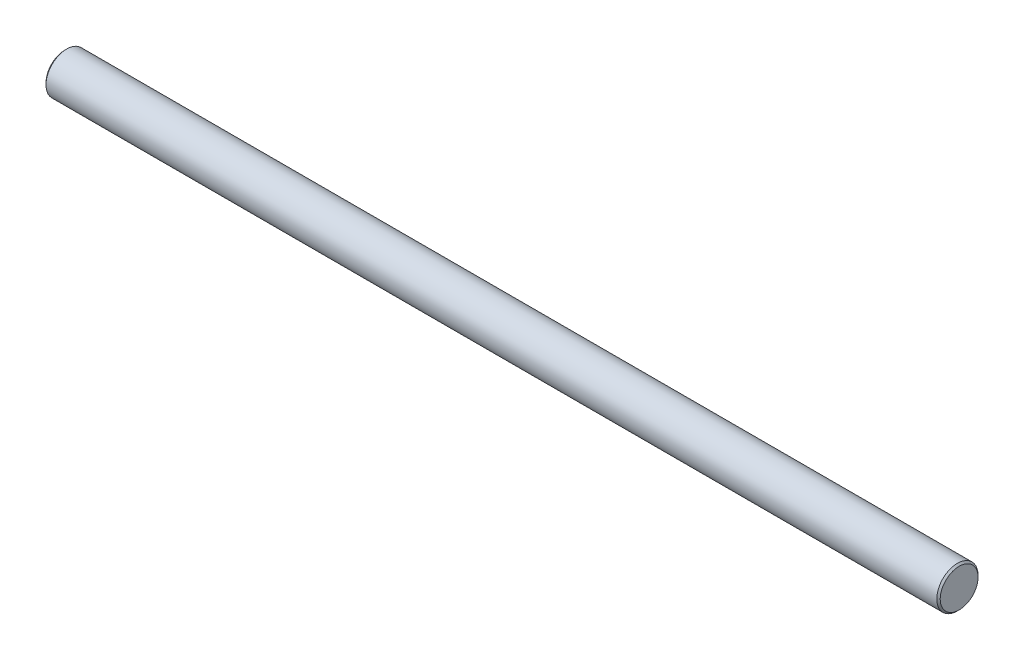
ISO-10303-21;
HEADER;
FILE_DESCRIPTION(('STEP AP214'),'2;1');
FILE_NAME('part.step','',(''),(''),'','','');
FILE_SCHEMA(('AUTOMOTIVE_DESIGN { 1 0 10303 214 1 1 1 1 }'));
ENDSEC;
DATA;
#1=APPLICATION_CONTEXT('core data for automotive mechanical design processes');
#2=APPLICATION_PROTOCOL_DEFINITION('international standard','automotive_design',2000,#1);
#3=PRODUCT_CONTEXT('',#1,'mechanical');
#4=PRODUCT('Part','Part','',(#3));
#5=PRODUCT_RELATED_PRODUCT_CATEGORY('part','',(#4));
#6=PRODUCT_DEFINITION_FORMATION('','',#4);
#7=PRODUCT_DEFINITION_CONTEXT('part definition',#1,'design');
#8=PRODUCT_DEFINITION('design','',#6,#7);
#9=PRODUCT_DEFINITION_SHAPE('','',#8);
#10=(LENGTH_UNIT() NAMED_UNIT(*) SI_UNIT(.MILLI.,.METRE.));
#11=(NAMED_UNIT(*) PLANE_ANGLE_UNIT() SI_UNIT($,.RADIAN.));
#12=(NAMED_UNIT(*) SI_UNIT($,.STERADIAN.) SOLID_ANGLE_UNIT());
#13=UNCERTAINTY_MEASURE_WITH_UNIT(LENGTH_MEASURE(1.E-05),#10,'distance_accuracy_value','');
#14=(GEOMETRIC_REPRESENTATION_CONTEXT(3) GLOBAL_UNCERTAINTY_ASSIGNED_CONTEXT((#13)) GLOBAL_UNIT_ASSIGNED_CONTEXT((#10,
#11,#12)) REPRESENTATION_CONTEXT('',''));
#15=CARTESIAN_POINT('',(0.,0.,0.));
#16=DIRECTION('',(0.,0.,1.));
#17=DIRECTION('',(1.,0.,0.));
#18=AXIS2_PLACEMENT_3D('',#15,#16,#17);
#19=CARTESIAN_POINT('',(-40.,0.,0.));
#20=DIRECTION('',(1.,0.,0.));
#21=DIRECTION('',(0.,0.,-1.));
#22=AXIS2_PLACEMENT_3D('',#19,#20,#21);
#23=PLANE('',#22);
#24=CARTESIAN_POINT('',(-40.,0.,0.));
#25=DIRECTION('',(1.,0.,0.));
#26=DIRECTION('',(0.,0.,-1.));
#27=AXIS2_PLACEMENT_3D('',#24,#25,#26);
#28=CIRCLE('',#27,2.75);
#29=CARTESIAN_POINT('',(-40.,0.,-2.75));
#30=VERTEX_POINT('',#29);
#31=EDGE_CURVE('E10',#30,#30,#28,.F.);
#32=ORIENTED_EDGE('',*,*,#31,.T.);
#33=EDGE_LOOP('',(#32));
#34=FACE_BOUND('',#33,.T.);
#35=ADVANCED_FACE('F30',(#34),#23,.F.);
#36=CARTESIAN_POINT('',(-16.2473877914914,0.,0.));
#37=DIRECTION('',(-1.,0.,0.));
#38=DIRECTION('',(0.,0.,1.));
#39=AXIS2_PLACEMENT_3D('',#36,#37,#38);
#40=CYLINDRICAL_SURFACE('',#39,3.);
#41=CARTESIAN_POINT('',(89.75,0.,0.));
#42=DIRECTION('',(-1.,0.,0.));
#43=DIRECTION('',(0.,0.,1.));
#44=AXIS2_PLACEMENT_3D('',#41,#42,#43);
#45=CIRCLE('',#44,3.);
#46=CARTESIAN_POINT('',(89.75,0.,3.));
#47=VERTEX_POINT('',#46);
#48=EDGE_CURVE('E41',#47,#47,#45,.T.);
#49=ORIENTED_EDGE('',*,*,#48,.T.);
#50=EDGE_LOOP('',(#49));
#51=FACE_BOUND('',#50,.T.);
#52=CARTESIAN_POINT('',(-39.75,0.,0.));
#53=DIRECTION('',(1.,0.,0.));
#54=DIRECTION('',(0.,0.,-1.));
#55=AXIS2_PLACEMENT_3D('',#52,#53,#54);
#56=CIRCLE('',#55,3.);
#57=CARTESIAN_POINT('',(-39.75,0.,-3.));
#58=VERTEX_POINT('',#57);
#59=EDGE_CURVE('E45',#58,#58,#56,.T.);
#60=ORIENTED_EDGE('',*,*,#59,.T.);
#61=EDGE_LOOP('',(#60));
#62=FACE_BOUND('',#61,.T.);
#63=ADVANCED_FACE('F51',(#51,#62),#40,.T.);
#64=CARTESIAN_POINT('',(90.,0.,0.));
#65=DIRECTION('',(-1.,0.,0.));
#66=DIRECTION('',(0.,0.,1.));
#67=AXIS2_PLACEMENT_3D('',#64,#65,#66);
#68=PLANE('',#67);
#69=CARTESIAN_POINT('',(90.,0.,0.));
#70=DIRECTION('',(-1.,0.,0.));
#71=DIRECTION('',(0.,0.,1.));
#72=AXIS2_PLACEMENT_3D('',#69,#70,#71);
#73=CIRCLE('',#72,2.74999999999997);
#74=CARTESIAN_POINT('',(90.,0.,2.74999999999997));
#75=VERTEX_POINT('',#74);
#76=EDGE_CURVE('E37',#75,#75,#73,.F.);
#77=ORIENTED_EDGE('',*,*,#76,.T.);
#78=EDGE_LOOP('',(#77));
#79=FACE_BOUND('',#78,.T.);
#80=ADVANCED_FACE('F59',(#79),#68,.F.);
#81=CARTESIAN_POINT('',(89.75,0.,0.));
#82=DIRECTION('',(-1.,0.,0.));
#83=DIRECTION('',(0.,0.,1.));
#84=AXIS2_PLACEMENT_3D('',#81,#82,#83);
#85=CONICAL_SURFACE('',#84,3.,0.785398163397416);
#86=ORIENTED_EDGE('',*,*,#76,.F.);
#87=EDGE_LOOP('',(#86));
#88=FACE_BOUND('',#87,.T.);
#89=ORIENTED_EDGE('',*,*,#48,.F.);
#90=EDGE_LOOP('',(#89));
#91=FACE_BOUND('',#90,.T.);
#92=ADVANCED_FACE('F55',(#88,#91),#85,.T.);
#93=CARTESIAN_POINT('',(-40.,0.,0.));
#94=DIRECTION('',(1.,0.,0.));
#95=DIRECTION('',(0.,0.,-1.));
#96=AXIS2_PLACEMENT_3D('',#93,#94,#95);
#97=CONICAL_SURFACE('',#96,2.75,0.785398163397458);
#98=ORIENTED_EDGE('',*,*,#59,.F.);
#99=EDGE_LOOP('',(#98));
#100=FACE_BOUND('',#99,.T.);
#101=ORIENTED_EDGE('',*,*,#31,.F.);
#102=EDGE_LOOP('',(#101));
#103=FACE_BOUND('',#102,.T.);
#104=ADVANCED_FACE('F32',(#100,#103),#97,.T.);
#105=CLOSED_SHELL('',(#35,#63,#80,#92,#104));
#106=MANIFOLD_SOLID_BREP('B2',#105);
#107=ADVANCED_BREP_SHAPE_REPRESENTATION('',(#18,#106),#14);
#108=SHAPE_DEFINITION_REPRESENTATION(#9,#107);
ENDSEC;
END-ISO-10303-21;
